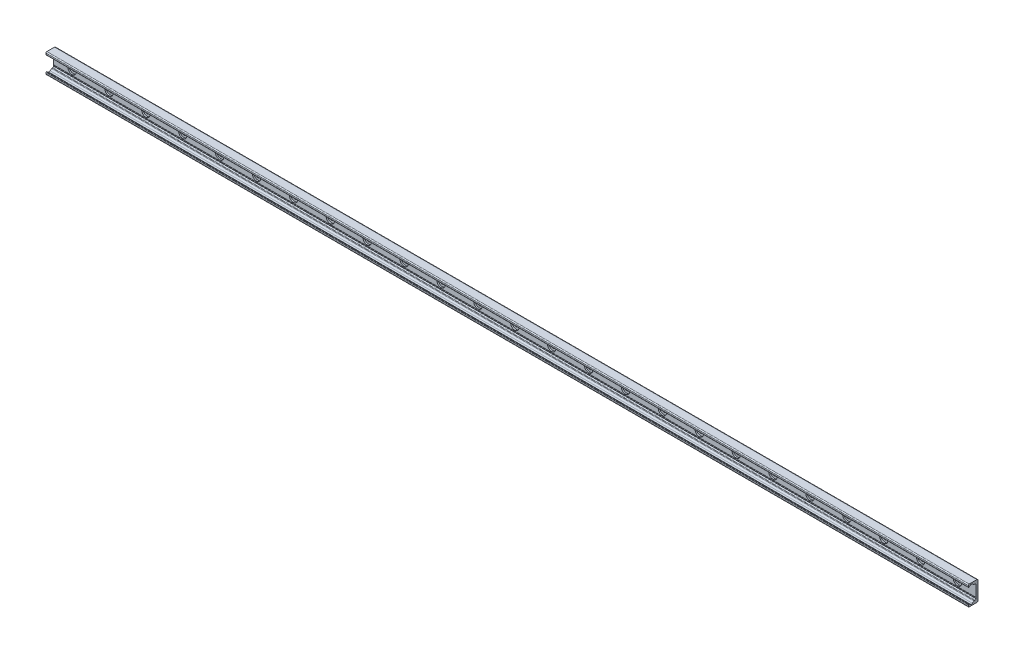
from build123d import *

# Parameters (mm, degrees)
BOSS_EXTRUDE1_DEPTH = 1000
SKETCH2_R           = 9
SKETCH2_R_2         = 4.5
CUT_EXTRUDE1_DEPTH  = 3.1
SKETCH2_2_R         = 4.5
CUT_EXTRUDE2_DEPTH  = 1001.367182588
LPATTERN1_COUNT     = 25
LPATTERN1_PITCH     = 80


with BuildPart() as part:
    # Sketch1 → Boss-Extrude1 (new, symmetric)
    with BuildSketch(Plane(origin=(0, 0, 0), x_dir=(0, 0, -1), z_dir=(1, 0, 0))):
        with BuildLine():
            Line((0, 0), (0, 19))
            ThreePointArc((0, 19), (-0.732233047, 20.767766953), (-2.5, 21.5))
            Line((-2.5, 21.5), (-19, 21.5))
            ThreePointArc((-19, 21.5), (-20.414213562, 20.914213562), (-21, 19.5))
            Line((-21, 19.5), (-21, 16.625057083))
            ThreePointArc((-21, 16.625057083), (-20.553251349, 15.888838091), (-19.693931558, 15.945160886))
            Line((-19.693931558, 15.945160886), (-16.794305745, 17.975500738))
            ThreePointArc((-16.794305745, 17.975500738), (-14.5, 18.69889256), (-12.205694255, 17.975500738))
            Line((-12.205694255, 17.975500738), (-8.829831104, 15.611695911))
            ThreePointArc((-8.829831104, 15.611695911), (-8.28408983, 15.342566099), (-7.682678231, 15.25))
            Line((-7.682678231, 15.25), (-6.5, 15.25))
            ThreePointArc((-6.5, 15.25), (-5.085786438, 14.664213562), (-4.5, 13.25))
            Line((-4.5, 13.25), (-4.5, -10.75))
            ThreePointArc((-4.5, -10.75), (-4.25, -11), (-4.5, -11.25))
            Line((-4.5, -11.25), (-4.5, -12.25))
            ThreePointArc((-4.5, -12.25), (-4.25, -12.5), (-4.5, -12.75))
            Line((-4.5, -12.75), (-4.5, -13.25))
            ThreePointArc((-4.5, -13.25), (-5.085786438, -14.664213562), (-6.5, -15.25))
            Line((-6.5, -15.25), (-7.682678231, -15.25))
            ThreePointArc((-7.682678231, -15.25), (-8.28408983, -15.342566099), (-8.829831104, -15.611695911))
            Line((-8.829831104, -15.611695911), (-12.205694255, -17.975500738))
            ThreePointArc((-12.205694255, -17.975500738), (-14.5, -18.69889256), (-16.794305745, -17.975500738))
            Line((-16.794305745, -17.975500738), (-19.693931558, -15.945160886))
            ThreePointArc((-19.693931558, -15.945160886), (-20.553251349, -15.888838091), (-21, -16.625057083))
            Line((-21, -16.625057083), (-21, -19.5))
            ThreePointArc((-21, -19.5), (-20.414213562, -20.914213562), (-19, -21.5))
            Line((-19, -21.5), (-2.5, -21.5))
            ThreePointArc((-2.5, -21.5), (-0.732233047, -20.767766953), (0, -19))
            Line((0, -19), (0, 0))
        make_face()
    extrude(amount=BOSS_EXTRUDE1_DEPTH, both=True)

    # Sketch2 → Cut-Extrude1 (cut)
    with BuildSketch(Plane.XY.offset(4.5)):
        with Locations((960, 0)):
            Circle(SKETCH2_R)
        with Locations((960, 0)):
            Circle(SKETCH2_R_2, mode=Mode.SUBTRACT)
    cut_extrude1 = extrude(amount=-CUT_EXTRUDE1_DEPTH, mode=Mode.SUBTRACT)

    # Sketch2_2 → Cut-Extrude2 (cut, through all)
    with BuildSketch(Plane.XY.offset(4.5)):
        with Locations((960, 0)):
            Circle(SKETCH2_2_R)
    cut_extrude2 = extrude(amount=-CUT_EXTRUDE2_DEPTH, mode=Mode.SUBTRACT)

    # LPattern1: Cut-Extrude1, Cut-Extrude2 ×25
    with Locations(*[(-i * LPATTERN1_PITCH, 0, 0) for i in range(1, LPATTERN1_COUNT)]):
        add(cut_extrude1, mode=Mode.SUBTRACT)
        add(cut_extrude2, mode=Mode.SUBTRACT)


solid = part.part
